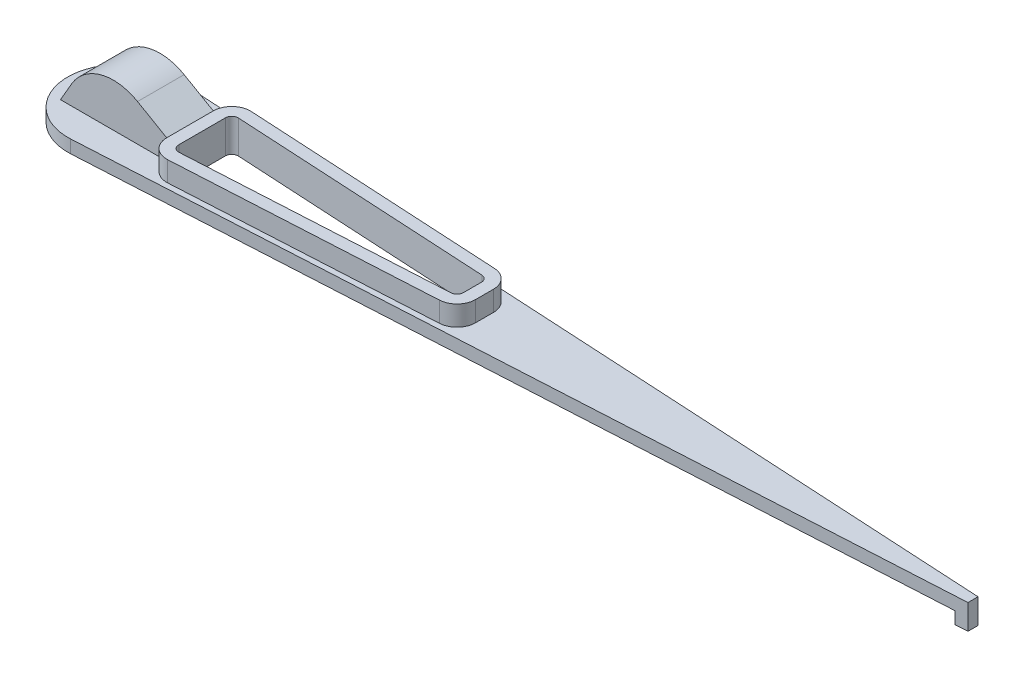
ISO-10303-21;
HEADER;
FILE_DESCRIPTION(('STEP AP214'),'2;1');
FILE_NAME('part.step','',(''),(''),'','','');
FILE_SCHEMA(('AUTOMOTIVE_DESIGN { 1 0 10303 214 1 1 1 1 }'));
ENDSEC;
DATA;
#1=APPLICATION_CONTEXT('core data for automotive mechanical design processes');
#2=APPLICATION_PROTOCOL_DEFINITION('international standard','automotive_design',2000,#1);
#3=PRODUCT_CONTEXT('',#1,'mechanical');
#4=PRODUCT('Part','Part','',(#3));
#5=PRODUCT_RELATED_PRODUCT_CATEGORY('part','',(#4));
#6=PRODUCT_DEFINITION_FORMATION('','',#4);
#7=PRODUCT_DEFINITION_CONTEXT('part definition',#1,'design');
#8=PRODUCT_DEFINITION('design','',#6,#7);
#9=PRODUCT_DEFINITION_SHAPE('','',#8);
#10=(LENGTH_UNIT() NAMED_UNIT(*) SI_UNIT(.MILLI.,.METRE.));
#11=(NAMED_UNIT(*) PLANE_ANGLE_UNIT() SI_UNIT($,.RADIAN.));
#12=(NAMED_UNIT(*) SI_UNIT($,.STERADIAN.) SOLID_ANGLE_UNIT());
#13=UNCERTAINTY_MEASURE_WITH_UNIT(LENGTH_MEASURE(1.E-05),#10,'distance_accuracy_value','');
#14=(GEOMETRIC_REPRESENTATION_CONTEXT(3) GLOBAL_UNCERTAINTY_ASSIGNED_CONTEXT((#13)) GLOBAL_UNIT_ASSIGNED_CONTEXT((#10,
#11,#12)) REPRESENTATION_CONTEXT('',''));
#15=CARTESIAN_POINT('',(0.,0.,0.));
#16=DIRECTION('',(0.,0.,1.));
#17=DIRECTION('',(1.,0.,0.));
#18=AXIS2_PLACEMENT_3D('',#15,#16,#17);
#19=CARTESIAN_POINT('',(0.,0.,0.));
#20=DIRECTION('',(0.,1.,0.));
#21=DIRECTION('',(0.,0.,1.));
#22=AXIS2_PLACEMENT_3D('',#19,#20,#21);
#23=PLANE('',#22);
#24=CARTESIAN_POINT('',(0.,0.,0.));
#25=DIRECTION('',(0.,1.,0.));
#26=DIRECTION('',(0.,0.,1.));
#27=AXIS2_PLACEMENT_3D('',#24,#25,#26);
#28=CIRCLE('',#27,5.);
#29=CARTESIAN_POINT('',(0.,0.,5.));
#30=VERTEX_POINT('',#29);
#31=EDGE_CURVE('E11',#30,#30,#28,.F.);
#32=ORIENTED_EDGE('',*,*,#31,.F.);
#33=EDGE_LOOP('',(#32));
#34=FACE_BOUND('',#33,.T.);
#35=DIRECTION('',(-0.998462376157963,0.,-0.0554335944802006));
#36=VECTOR('',#35,1.);
#37=CARTESIAN_POINT('',(43.0443468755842,0.,-1.91684451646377));
#38=LINE('',#37,#36);
#39=CARTESIAN_POINT('',(43.0443468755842,0.,-1.91684451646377));
#40=VERTEX_POINT('',#39);
#41=CARTESIAN_POINT('',(11.0443468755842,0.,-3.69345129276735));
#42=VERTEX_POINT('',#41);
#43=EDGE_CURVE('E277',#40,#42,#38,.T.);
#44=ORIENTED_EDGE('',*,*,#43,.T.);
#45=CARTESIAN_POINT('',(11.,0.,-2.89468139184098));
#46=DIRECTION('',(0.,1.,0.));
#47=DIRECTION('',(0.,0.,1.));
#48=AXIS2_PLACEMENT_3D('',#45,#46,#47);
#49=CIRCLE('',#48,0.800000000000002);
#50=CARTESIAN_POINT('',(10.2,0.,-2.89468139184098));
#51=VERTEX_POINT('',#50);
#52=EDGE_CURVE('E255',#42,#51,#49,.T.);
#53=ORIENTED_EDGE('',*,*,#52,.T.);
#54=DIRECTION('',(0.,0.,1.));
#55=VECTOR('',#54,1.);
#56=CARTESIAN_POINT('',(10.2,0.,-2.89468139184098));
#57=LINE('',#56,#55);
#58=CARTESIAN_POINT('',(10.2,0.,2.89468139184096));
#59=VERTEX_POINT('',#58);
#60=EDGE_CURVE('E258',#51,#59,#57,.T.);
#61=ORIENTED_EDGE('',*,*,#60,.T.);
#62=CARTESIAN_POINT('',(11.,0.,2.89468139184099));
#63=DIRECTION('',(0.,1.,0.));
#64=DIRECTION('',(0.,0.,1.));
#65=AXIS2_PLACEMENT_3D('',#62,#63,#64);
#66=CIRCLE('',#65,0.799999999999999);
#67=CARTESIAN_POINT('',(11.0443468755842,0.,3.69345129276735));
#68=VERTEX_POINT('',#67);
#69=EDGE_CURVE('E262',#59,#68,#66,.T.);
#70=ORIENTED_EDGE('',*,*,#69,.T.);
#71=DIRECTION('',(0.998462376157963,0.,-0.0554335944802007));
#72=VECTOR('',#71,1.);
#73=CARTESIAN_POINT('',(11.0443468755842,0.,3.69345129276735));
#74=LINE('',#73,#72);
#75=CARTESIAN_POINT('',(43.0443468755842,0.,1.91684451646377));
#76=VERTEX_POINT('',#75);
#77=EDGE_CURVE('E265',#68,#76,#74,.T.);
#78=ORIENTED_EDGE('',*,*,#77,.T.);
#79=CARTESIAN_POINT('',(43.,0.,1.11807461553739));
#80=DIRECTION('',(0.,1.,0.));
#81=DIRECTION('',(0.,0.,1.));
#82=AXIS2_PLACEMENT_3D('',#79,#80,#81);
#83=CIRCLE('',#82,0.800000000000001);
#84=CARTESIAN_POINT('',(43.8,0.,1.11807461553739));
#85=VERTEX_POINT('',#84);
#86=EDGE_CURVE('E268',#76,#85,#83,.T.);
#87=ORIENTED_EDGE('',*,*,#86,.T.);
#88=DIRECTION('',(0.,0.,-1.));
#89=VECTOR('',#88,1.);
#90=CARTESIAN_POINT('',(43.8,0.,1.11807461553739));
#91=LINE('',#90,#89);
#92=CARTESIAN_POINT('',(43.8,0.,-1.11807461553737));
#93=VERTEX_POINT('',#92);
#94=EDGE_CURVE('E271',#85,#93,#91,.T.);
#95=ORIENTED_EDGE('',*,*,#94,.T.);
#96=CARTESIAN_POINT('',(43.,0.,-1.11807461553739));
#97=DIRECTION('',(0.,1.,0.));
#98=DIRECTION('',(0.,0.,1.));
#99=AXIS2_PLACEMENT_3D('',#96,#97,#98);
#100=CIRCLE('',#99,0.800000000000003);
#101=EDGE_CURVE('E274',#93,#40,#100,.T.);
#102=ORIENTED_EDGE('',*,*,#101,.T.);
#103=EDGE_LOOP('',(#44,#53,#61,#70,#78,#87,#95,#102));
#104=FACE_BOUND('',#103,.T.);
#105=DIRECTION('',(0.,0.,-1.));
#106=VECTOR('',#105,1.);
#107=CARTESIAN_POINT('',(104.5,0.,-0.708278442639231));
#108=LINE('',#107,#106);
#109=CARTESIAN_POINT('',(104.5,0.,0.70827844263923));
#110=VERTEX_POINT('',#109);
#111=CARTESIAN_POINT('',(104.5,0.,-0.708278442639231));
#112=VERTEX_POINT('',#111);
#113=EDGE_CURVE('E225',#110,#112,#108,.T.);
#114=ORIENTED_EDGE('',*,*,#113,.F.);
#115=DIRECTION('',(0.998462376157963,0.,-0.0554335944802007));
#116=VECTOR('',#115,1.);
#117=CARTESIAN_POINT('',(106.,0.,0.625));
#118=LINE('',#117,#116);
#119=CARTESIAN_POINT('',(0.360318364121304,0.,6.49000544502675));
#120=VERTEX_POINT('',#119);
#121=EDGE_CURVE('E231',#120,#110,#118,.T.);
#122=ORIENTED_EDGE('',*,*,#121,.F.);
#123=CARTESIAN_POINT('',(0.,0.,0.));
#124=DIRECTION('',(0.,1.,0.));
#125=DIRECTION('',(0.,0.,1.));
#126=AXIS2_PLACEMENT_3D('',#123,#124,#125);
#127=CIRCLE('',#126,6.5);
#128=CARTESIAN_POINT('',(0.360318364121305,0.,-6.49000544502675));
#129=VERTEX_POINT('',#128);
#130=EDGE_CURVE('E386',#129,#120,#127,.T.);
#131=ORIENTED_EDGE('',*,*,#130,.F.);
#132=DIRECTION('',(-0.998462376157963,0.,-0.0554335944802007));
#133=VECTOR('',#132,1.);
#134=CARTESIAN_POINT('',(106.,0.,-0.625));
#135=LINE('',#134,#133);
#136=EDGE_CURVE('E374',#112,#129,#135,.T.);
#137=ORIENTED_EDGE('',*,*,#136,.F.);
#138=EDGE_LOOP('',(#114,#122,#131,#137));
#139=FACE_BOUND('',#138,.T.);
#140=ADVANCED_FACE('F36',(#34,#104,#139),#23,.F.);
#141=CARTESIAN_POINT('',(0.,1.6,0.));
#142=DIRECTION('',(0.,1.,0.));
#143=DIRECTION('',(0.,0.,1.));
#144=AXIS2_PLACEMENT_3D('',#141,#142,#143);
#145=PLANE('',#144);
#146=DIRECTION('',(-0.998462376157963,0.,-0.0554335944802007));
#147=VECTOR('',#146,1.);
#148=CARTESIAN_POINT('',(106.,1.6,-0.625));
#149=LINE('',#148,#147);
#150=CARTESIAN_POINT('',(106.,1.6,-0.625));
#151=VERTEX_POINT('',#150);
#152=CARTESIAN_POINT('',(0.360318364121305,1.6,-6.49000544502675));
#153=VERTEX_POINT('',#152);
#154=EDGE_CURVE('E375',#151,#153,#149,.T.);
#155=ORIENTED_EDGE('',*,*,#154,.T.);
#156=CARTESIAN_POINT('',(0.,1.6,0.));
#157=DIRECTION('',(0.,1.,0.));
#158=DIRECTION('',(0.,0.,1.));
#159=AXIS2_PLACEMENT_3D('',#156,#157,#158);
#160=CIRCLE('',#159,6.5);
#161=CARTESIAN_POINT('',(0.360318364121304,1.6,6.49000544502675));
#162=VERTEX_POINT('',#161);
#163=EDGE_CURVE('E378',#153,#162,#160,.T.);
#164=ORIENTED_EDGE('',*,*,#163,.T.);
#165=DIRECTION('',(0.998462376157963,0.,-0.0554335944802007));
#166=VECTOR('',#165,1.);
#167=CARTESIAN_POINT('',(106.,1.6,0.625));
#168=LINE('',#167,#166);
#169=CARTESIAN_POINT('',(106.,1.6,0.625));
#170=VERTEX_POINT('',#169);
#171=EDGE_CURVE('E380',#162,#170,#168,.T.);
#172=ORIENTED_EDGE('',*,*,#171,.T.);
#173=DIRECTION('',(0.,0.,-1.));
#174=VECTOR('',#173,1.);
#175=CARTESIAN_POINT('',(106.,1.6,-0.625));
#176=LINE('',#175,#174);
#177=EDGE_CURVE('E382',#170,#151,#176,.T.);
#178=ORIENTED_EDGE('',*,*,#177,.T.);
#179=EDGE_LOOP('',(#155,#164,#172,#178));
#180=FACE_BOUND('',#179,.T.);
#181=DIRECTION('',(0.,0.,1.));
#182=VECTOR('',#181,1.);
#183=CARTESIAN_POINT('',(-4.5,1.6,-2.89468139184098));
#184=LINE('',#183,#182);
#185=CARTESIAN_POINT('',(-4.5,1.6,-2.89468139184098));
#186=VERTEX_POINT('',#185);
#187=CARTESIAN_POINT('',(-4.5,1.6,2.89468139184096));
#188=VERTEX_POINT('',#187);
#189=EDGE_CURVE('E252',#186,#188,#184,.T.);
#190=ORIENTED_EDGE('',*,*,#189,.F.);
#191=DIRECTION('',(-1.,0.,0.));
#192=VECTOR('',#191,1.);
#193=CARTESIAN_POINT('',(8.7,1.6,-2.89468139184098));
#194=LINE('',#193,#192);
#195=CARTESIAN_POINT('',(8.7,1.6,-2.89468139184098));
#196=VERTEX_POINT('',#195);
#197=EDGE_CURVE('E246',#196,#186,#194,.T.);
#198=ORIENTED_EDGE('',*,*,#197,.F.);
#199=CARTESIAN_POINT('',(11.,1.6,-2.89468139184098));
#200=DIRECTION('',(0.,1.,0.));
#201=DIRECTION('',(0.,0.,-1.));
#202=AXIS2_PLACEMENT_3D('',#199,#200,#201);
#203=CIRCLE('',#202,2.3);
#204=CARTESIAN_POINT('',(11.1274972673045,1.6,-5.1911448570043));
#205=VERTEX_POINT('',#204);
#206=EDGE_CURVE('E304',#205,#196,#203,.T.);
#207=ORIENTED_EDGE('',*,*,#206,.F.);
#208=DIRECTION('',(-0.998462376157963,0.,-0.0554335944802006));
#209=VECTOR('',#208,1.);
#210=CARTESIAN_POINT('',(43.1274972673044,1.6,-3.41453808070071));
#211=LINE('',#210,#209);
#212=CARTESIAN_POINT('',(43.1274972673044,1.6,-3.41453808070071));
#213=VERTEX_POINT('',#212);
#214=EDGE_CURVE('E323',#213,#205,#211,.T.);
#215=ORIENTED_EDGE('',*,*,#214,.F.);
#216=CARTESIAN_POINT('',(43.,1.6,-1.11807461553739));
#217=DIRECTION('',(0.,1.,0.));
#218=DIRECTION('',(0.,0.,-1.));
#219=AXIS2_PLACEMENT_3D('',#216,#217,#218);
#220=CIRCLE('',#219,2.3);
#221=CARTESIAN_POINT('',(45.3,1.6,-1.11807461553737));
#222=VERTEX_POINT('',#221);
#223=EDGE_CURVE('E349',#222,#213,#220,.T.);
#224=ORIENTED_EDGE('',*,*,#223,.F.);
#225=DIRECTION('',(0.,0.,-1.));
#226=VECTOR('',#225,1.);
#227=CARTESIAN_POINT('',(45.3,1.6,-1.11807461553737));
#228=LINE('',#227,#226);
#229=CARTESIAN_POINT('',(45.3,1.6,1.11807461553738));
#230=VERTEX_POINT('',#229);
#231=EDGE_CURVE('E347',#230,#222,#228,.T.);
#232=ORIENTED_EDGE('',*,*,#231,.F.);
#233=CARTESIAN_POINT('',(43.,1.6,1.11807461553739));
#234=DIRECTION('',(0.,1.,0.));
#235=DIRECTION('',(0.,0.,-1.));
#236=AXIS2_PLACEMENT_3D('',#233,#234,#235);
#237=CIRCLE('',#236,2.3);
#238=CARTESIAN_POINT('',(43.1274972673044,1.6,3.41453808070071));
#239=VERTEX_POINT('',#238);
#240=EDGE_CURVE('E345',#239,#230,#237,.T.);
#241=ORIENTED_EDGE('',*,*,#240,.F.);
#242=DIRECTION('',(0.998462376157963,0.,-0.0554335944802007));
#243=VECTOR('',#242,1.);
#244=CARTESIAN_POINT('',(11.1274972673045,1.6,5.1911448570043));
#245=LINE('',#244,#243);
#246=CARTESIAN_POINT('',(11.1274972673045,1.6,5.1911448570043));
#247=VERTEX_POINT('',#246);
#248=EDGE_CURVE('E343',#247,#239,#245,.T.);
#249=ORIENTED_EDGE('',*,*,#248,.F.);
#250=CARTESIAN_POINT('',(11.,1.6,2.89468139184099));
#251=DIRECTION('',(0.,1.,0.));
#252=DIRECTION('',(0.,0.,-1.));
#253=AXIS2_PLACEMENT_3D('',#250,#251,#252);
#254=CIRCLE('',#253,2.3);
#255=CARTESIAN_POINT('',(8.7,1.6,2.89468139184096));
#256=VERTEX_POINT('',#255);
#257=EDGE_CURVE('E341',#256,#247,#254,.T.);
#258=ORIENTED_EDGE('',*,*,#257,.F.);
#259=DIRECTION('',(-1.,0.,0.));
#260=VECTOR('',#259,1.);
#261=CARTESIAN_POINT('',(8.7,1.6,2.89468139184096));
#262=LINE('',#261,#260);
#263=EDGE_CURVE('E235',#256,#188,#262,.T.);
#264=ORIENTED_EDGE('',*,*,#263,.T.);
#265=EDGE_LOOP('',(#190,#198,#207,#215,#224,#232,#241,#249,#258,#264));
#266=FACE_BOUND('',#265,.T.);
#267=ADVANCED_FACE('F422',(#180,#266),#145,.T.);
#268=CARTESIAN_POINT('',(106.,1.6,-0.625));
#269=DIRECTION('',(-0.0554335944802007,0.,0.998462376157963));
#270=DIRECTION('',(0.998462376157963,0.,0.0554335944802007));
#271=AXIS2_PLACEMENT_3D('',#268,#269,#270);
#272=PLANE('',#271);
#273=DIRECTION('',(0.,-1.,0.));
#274=VECTOR('',#273,1.);
#275=CARTESIAN_POINT('',(106.,1.6,-0.625));
#276=LINE('',#275,#274);
#277=CARTESIAN_POINT('',(106.,-1.5,-0.625));
#278=VERTEX_POINT('',#277);
#279=EDGE_CURVE('E384',#151,#278,#276,.T.);
#280=ORIENTED_EDGE('',*,*,#279,.T.);
#281=DIRECTION('',(0.998462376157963,0.,0.0554335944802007));
#282=VECTOR('',#281,1.);
#283=CARTESIAN_POINT('',(106.,-1.5,-0.625));
#284=LINE('',#283,#282);
#285=CARTESIAN_POINT('',(104.5,-1.5,-0.708278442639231));
#286=VERTEX_POINT('',#285);
#287=EDGE_CURVE('E215',#286,#278,#284,.T.);
#288=ORIENTED_EDGE('',*,*,#287,.F.);
#289=DIRECTION('',(0.,1.,0.));
#290=VECTOR('',#289,1.);
#291=CARTESIAN_POINT('',(104.5,-1.5,-0.708278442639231));
#292=LINE('',#291,#290);
#293=EDGE_CURVE('E211',#286,#112,#292,.T.);
#294=ORIENTED_EDGE('',*,*,#293,.T.);
#295=ORIENTED_EDGE('',*,*,#136,.T.);
#296=DIRECTION('',(0.,-1.,0.));
#297=VECTOR('',#296,1.);
#298=CARTESIAN_POINT('',(0.360318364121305,1.6,-6.49000544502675));
#299=LINE('',#298,#297);
#300=EDGE_CURVE('E394',#153,#129,#299,.T.);
#301=ORIENTED_EDGE('',*,*,#300,.F.);
#302=ORIENTED_EDGE('',*,*,#154,.F.);
#303=EDGE_LOOP('',(#280,#288,#294,#295,#301,#302));
#304=FACE_BOUND('',#303,.T.);
#305=ADVANCED_FACE('F428',(#304),#272,.F.);
#306=CARTESIAN_POINT('',(0.,1.6,0.));
#307=DIRECTION('',(0.,-1.,0.));
#308=DIRECTION('',(0.,0.,-1.));
#309=AXIS2_PLACEMENT_3D('',#306,#307,#308);
#310=CYLINDRICAL_SURFACE('',#309,6.5);
#311=ORIENTED_EDGE('',*,*,#130,.T.);
#312=DIRECTION('',(0.,-1.,0.));
#313=VECTOR('',#312,1.);
#314=CARTESIAN_POINT('',(0.360318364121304,1.6,6.49000544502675));
#315=LINE('',#314,#313);
#316=EDGE_CURVE('E392',#162,#120,#315,.T.);
#317=ORIENTED_EDGE('',*,*,#316,.F.);
#318=ORIENTED_EDGE('',*,*,#163,.F.);
#319=ORIENTED_EDGE('',*,*,#300,.T.);
#320=EDGE_LOOP('',(#311,#317,#318,#319));
#321=FACE_BOUND('',#320,.T.);
#322=ADVANCED_FACE('F442',(#321),#310,.T.);
#323=CARTESIAN_POINT('',(106.,1.6,0.625));
#324=DIRECTION('',(-0.0554335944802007,0.,-0.998462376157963));
#325=DIRECTION('',(-0.998462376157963,0.,0.0554335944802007));
#326=AXIS2_PLACEMENT_3D('',#323,#324,#325);
#327=PLANE('',#326);
#328=ORIENTED_EDGE('',*,*,#121,.T.);
#329=DIRECTION('',(0.,1.,0.));
#330=VECTOR('',#329,1.);
#331=CARTESIAN_POINT('',(104.5,-1.5,0.70827844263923));
#332=LINE('',#331,#330);
#333=CARTESIAN_POINT('',(104.5,-1.5,0.70827844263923));
#334=VERTEX_POINT('',#333);
#335=EDGE_CURVE('E208',#334,#110,#332,.T.);
#336=ORIENTED_EDGE('',*,*,#335,.F.);
#337=DIRECTION('',(-0.998462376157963,0.,0.0554335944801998));
#338=VECTOR('',#337,1.);
#339=CARTESIAN_POINT('',(104.5,-1.5,0.70827844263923));
#340=LINE('',#339,#338);
#341=CARTESIAN_POINT('',(106.,-1.5,0.625));
#342=VERTEX_POINT('',#341);
#343=EDGE_CURVE('E216',#342,#334,#340,.T.);
#344=ORIENTED_EDGE('',*,*,#343,.F.);
#345=DIRECTION('',(0.,-1.,0.));
#346=VECTOR('',#345,1.);
#347=CARTESIAN_POINT('',(106.,1.6,0.625));
#348=LINE('',#347,#346);
#349=EDGE_CURVE('E390',#170,#342,#348,.T.);
#350=ORIENTED_EDGE('',*,*,#349,.F.);
#351=ORIENTED_EDGE('',*,*,#171,.F.);
#352=ORIENTED_EDGE('',*,*,#316,.T.);
#353=EDGE_LOOP('',(#328,#336,#344,#350,#351,#352));
#354=FACE_BOUND('',#353,.T.);
#355=ADVANCED_FACE('F228',(#354),#327,.F.);
#356=CARTESIAN_POINT('',(106.,1.6,-0.625));
#357=DIRECTION('',(-1.,0.,0.));
#358=DIRECTION('',(0.,0.,1.));
#359=AXIS2_PLACEMENT_3D('',#356,#357,#358);
#360=PLANE('',#359);
#361=ORIENTED_EDGE('',*,*,#349,.T.);
#362=DIRECTION('',(0.,0.,1.));
#363=VECTOR('',#362,1.);
#364=CARTESIAN_POINT('',(106.,-1.5,0.625));
#365=LINE('',#364,#363);
#366=EDGE_CURVE('E222',#278,#342,#365,.T.);
#367=ORIENTED_EDGE('',*,*,#366,.F.);
#368=ORIENTED_EDGE('',*,*,#279,.F.);
#369=ORIENTED_EDGE('',*,*,#177,.F.);
#370=EDGE_LOOP('',(#361,#367,#368,#369));
#371=FACE_BOUND('',#370,.T.);
#372=ADVANCED_FACE('F435',(#371),#360,.F.);
#373=CARTESIAN_POINT('',(11.,4.1,-2.89468139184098));
#374=DIRECTION('',(0.,-1.,0.));
#375=DIRECTION('',(0.,0.,-1.));
#376=AXIS2_PLACEMENT_3D('',#373,#374,#375);
#377=CYLINDRICAL_SURFACE('',#376,2.3);
#378=ORIENTED_EDGE('',*,*,#206,.T.);
#379=DIRECTION('',(0.,-1.,0.));
#380=VECTOR('',#379,1.);
#381=CARTESIAN_POINT('',(8.7,4.1,-2.89468139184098));
#382=LINE('',#381,#380);
#383=CARTESIAN_POINT('',(8.7,4.1,-2.89468139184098));
#384=VERTEX_POINT('',#383);
#385=EDGE_CURVE('E372',#384,#196,#382,.T.);
#386=ORIENTED_EDGE('',*,*,#385,.F.);
#387=CARTESIAN_POINT('',(11.,4.1,-2.89468139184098));
#388=DIRECTION('',(0.,1.,0.));
#389=DIRECTION('',(0.,0.,-1.));
#390=AXIS2_PLACEMENT_3D('',#387,#388,#389);
#391=CIRCLE('',#390,2.3);
#392=CARTESIAN_POINT('',(11.1274972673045,4.1,-5.1911448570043));
#393=VERTEX_POINT('',#392);
#394=EDGE_CURVE('E319',#393,#384,#391,.T.);
#395=ORIENTED_EDGE('',*,*,#394,.F.);
#396=DIRECTION('',(0.,-1.,0.));
#397=VECTOR('',#396,1.);
#398=CARTESIAN_POINT('',(11.1274972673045,4.1,-5.1911448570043));
#399=LINE('',#398,#397);
#400=EDGE_CURVE('E338',#393,#205,#399,.T.);
#401=ORIENTED_EDGE('',*,*,#400,.T.);
#402=EDGE_LOOP('',(#378,#386,#395,#401));
#403=FACE_BOUND('',#402,.T.);
#404=ADVANCED_FACE('F438',(#403),#377,.T.);
#405=CARTESIAN_POINT('',(11.,4.1,2.89468139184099));
#406=DIRECTION('',(0.,-1.,0.));
#407=DIRECTION('',(0.,0.,-1.));
#408=AXIS2_PLACEMENT_3D('',#405,#406,#407);
#409=CYLINDRICAL_SURFACE('',#408,2.3);
#410=ORIENTED_EDGE('',*,*,#257,.T.);
#411=DIRECTION('',(0.,-1.,0.));
#412=VECTOR('',#411,1.);
#413=CARTESIAN_POINT('',(11.1274972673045,4.1,5.1911448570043));
#414=LINE('',#413,#412);
#415=CARTESIAN_POINT('',(11.1274972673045,4.1,5.1911448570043));
#416=VERTEX_POINT('',#415);
#417=EDGE_CURVE('E366',#416,#247,#414,.T.);
#418=ORIENTED_EDGE('',*,*,#417,.F.);
#419=CARTESIAN_POINT('',(11.,4.1,2.89468139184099));
#420=DIRECTION('',(0.,1.,0.));
#421=DIRECTION('',(0.,0.,-1.));
#422=AXIS2_PLACEMENT_3D('',#419,#420,#421);
#423=CIRCLE('',#422,2.3);
#424=CARTESIAN_POINT('',(8.7,4.1,2.89468139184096));
#425=VERTEX_POINT('',#424);
#426=EDGE_CURVE('E326',#425,#416,#423,.T.);
#427=ORIENTED_EDGE('',*,*,#426,.F.);
#428=DIRECTION('',(0.,-1.,0.));
#429=VECTOR('',#428,1.);
#430=CARTESIAN_POINT('',(8.7,4.1,2.89468139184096));
#431=LINE('',#430,#429);
#432=EDGE_CURVE('E369',#425,#256,#431,.T.);
#433=ORIENTED_EDGE('',*,*,#432,.T.);
#434=EDGE_LOOP('',(#410,#418,#427,#433));
#435=FACE_BOUND('',#434,.T.);
#436=ADVANCED_FACE('F469',(#435),#409,.T.);
#437=CARTESIAN_POINT('',(11.1274972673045,4.1,5.1911448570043));
#438=DIRECTION('',(-0.0554335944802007,0.,-0.998462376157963));
#439=DIRECTION('',(-0.998462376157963,0.,0.0554335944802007));
#440=AXIS2_PLACEMENT_3D('',#437,#438,#439);
#441=PLANE('',#440);
#442=ORIENTED_EDGE('',*,*,#248,.T.);
#443=DIRECTION('',(0.,-1.,0.));
#444=VECTOR('',#443,1.);
#445=CARTESIAN_POINT('',(43.1274972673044,4.1,3.41453808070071));
#446=LINE('',#445,#444);
#447=CARTESIAN_POINT('',(43.1274972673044,4.1,3.41453808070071));
#448=VERTEX_POINT('',#447);
#449=EDGE_CURVE('E363',#448,#239,#446,.T.);
#450=ORIENTED_EDGE('',*,*,#449,.F.);
#451=DIRECTION('',(0.998462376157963,0.,-0.0554335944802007));
#452=VECTOR('',#451,1.);
#453=CARTESIAN_POINT('',(11.1274972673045,4.1,5.1911448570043));
#454=LINE('',#453,#452);
#455=EDGE_CURVE('E328',#416,#448,#454,.T.);
#456=ORIENTED_EDGE('',*,*,#455,.F.);
#457=ORIENTED_EDGE('',*,*,#417,.T.);
#458=EDGE_LOOP('',(#442,#450,#456,#457));
#459=FACE_BOUND('',#458,.T.);
#460=ADVANCED_FACE('F476',(#459),#441,.F.);
#461=CARTESIAN_POINT('',(43.,4.1,1.11807461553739));
#462=DIRECTION('',(0.,-1.,0.));
#463=DIRECTION('',(0.,0.,-1.));
#464=AXIS2_PLACEMENT_3D('',#461,#462,#463);
#465=CYLINDRICAL_SURFACE('',#464,2.3);
#466=ORIENTED_EDGE('',*,*,#240,.T.);
#467=DIRECTION('',(0.,-1.,0.));
#468=VECTOR('',#467,1.);
#469=CARTESIAN_POINT('',(45.3,4.1,1.11807461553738));
#470=LINE('',#469,#468);
#471=CARTESIAN_POINT('',(45.3,4.1,1.11807461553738));
#472=VERTEX_POINT('',#471);
#473=EDGE_CURVE('E360',#472,#230,#470,.T.);
#474=ORIENTED_EDGE('',*,*,#473,.F.);
#475=CARTESIAN_POINT('',(43.,4.1,1.11807461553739));
#476=DIRECTION('',(0.,1.,0.));
#477=DIRECTION('',(0.,0.,-1.));
#478=AXIS2_PLACEMENT_3D('',#475,#476,#477);
#479=CIRCLE('',#478,2.3);
#480=EDGE_CURVE('E330',#448,#472,#479,.T.);
#481=ORIENTED_EDGE('',*,*,#480,.F.);
#482=ORIENTED_EDGE('',*,*,#449,.T.);
#483=EDGE_LOOP('',(#466,#474,#481,#482));
#484=FACE_BOUND('',#483,.T.);
#485=ADVANCED_FACE('F480',(#484),#465,.T.);
#486=CARTESIAN_POINT('',(45.3,4.1,-1.11807461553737));
#487=DIRECTION('',(-1.,0.,0.));
#488=DIRECTION('',(0.,0.,1.));
#489=AXIS2_PLACEMENT_3D('',#486,#487,#488);
#490=PLANE('',#489);
#491=ORIENTED_EDGE('',*,*,#231,.T.);
#492=DIRECTION('',(0.,-1.,0.));
#493=VECTOR('',#492,1.);
#494=CARTESIAN_POINT('',(45.3,4.1,-1.11807461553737));
#495=LINE('',#494,#493);
#496=CARTESIAN_POINT('',(45.3,4.1,-1.11807461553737));
#497=VERTEX_POINT('',#496);
#498=EDGE_CURVE('E357',#497,#222,#495,.T.);
#499=ORIENTED_EDGE('',*,*,#498,.F.);
#500=DIRECTION('',(0.,0.,-1.));
#501=VECTOR('',#500,1.);
#502=CARTESIAN_POINT('',(45.3,4.1,-1.11807461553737));
#503=LINE('',#502,#501);
#504=EDGE_CURVE('E332',#472,#497,#503,.T.);
#505=ORIENTED_EDGE('',*,*,#504,.F.);
#506=ORIENTED_EDGE('',*,*,#473,.T.);
#507=EDGE_LOOP('',(#491,#499,#505,#506));
#508=FACE_BOUND('',#507,.T.);
#509=ADVANCED_FACE('F500',(#508),#490,.F.);
#510=CARTESIAN_POINT('',(43.,4.1,-1.11807461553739));
#511=DIRECTION('',(0.,-1.,0.));
#512=DIRECTION('',(0.,0.,-1.));
#513=AXIS2_PLACEMENT_3D('',#510,#511,#512);
#514=CYLINDRICAL_SURFACE('',#513,2.3);
#515=ORIENTED_EDGE('',*,*,#223,.T.);
#516=DIRECTION('',(0.,-1.,0.));
#517=VECTOR('',#516,1.);
#518=CARTESIAN_POINT('',(43.1274972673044,4.1,-3.41453808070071));
#519=LINE('',#518,#517);
#520=CARTESIAN_POINT('',(43.1274972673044,4.1,-3.41453808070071));
#521=VERTEX_POINT('',#520);
#522=EDGE_CURVE('E355',#521,#213,#519,.T.);
#523=ORIENTED_EDGE('',*,*,#522,.F.);
#524=CARTESIAN_POINT('',(43.,4.1,-1.11807461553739));
#525=DIRECTION('',(0.,1.,0.));
#526=DIRECTION('',(0.,0.,-1.));
#527=AXIS2_PLACEMENT_3D('',#524,#525,#526);
#528=CIRCLE('',#527,2.3);
#529=EDGE_CURVE('E334',#497,#521,#528,.T.);
#530=ORIENTED_EDGE('',*,*,#529,.F.);
#531=ORIENTED_EDGE('',*,*,#498,.T.);
#532=EDGE_LOOP('',(#515,#523,#530,#531));
#533=FACE_BOUND('',#532,.T.);
#534=ADVANCED_FACE('F498',(#533),#514,.T.);
#535=CARTESIAN_POINT('',(43.1274972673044,4.1,-3.41453808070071));
#536=DIRECTION('',(-0.0554335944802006,0.,0.998462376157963));
#537=DIRECTION('',(0.998462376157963,0.,0.0554335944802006));
#538=AXIS2_PLACEMENT_3D('',#535,#536,#537);
#539=PLANE('',#538);
#540=ORIENTED_EDGE('',*,*,#214,.T.);
#541=ORIENTED_EDGE('',*,*,#400,.F.);
#542=DIRECTION('',(-0.998462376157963,0.,-0.0554335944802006));
#543=VECTOR('',#542,1.);
#544=CARTESIAN_POINT('',(43.1274972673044,4.1,-3.41453808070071));
#545=LINE('',#544,#543);
#546=EDGE_CURVE('E336',#521,#393,#545,.T.);
#547=ORIENTED_EDGE('',*,*,#546,.F.);
#548=ORIENTED_EDGE('',*,*,#522,.T.);
#549=EDGE_LOOP('',(#540,#541,#547,#548));
#550=FACE_BOUND('',#549,.T.);
#551=ADVANCED_FACE('F494',(#550),#539,.F.);
#552=CARTESIAN_POINT('',(11.,4.1,-2.89468139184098));
#553=DIRECTION('',(0.,-1.,0.));
#554=DIRECTION('',(0.,0.,-1.));
#555=AXIS2_PLACEMENT_3D('',#552,#553,#554);
#556=PLANE('',#555);
#557=DIRECTION('',(0.,0.,1.));
#558=VECTOR('',#557,1.);
#559=CARTESIAN_POINT('',(10.2,4.1,-2.89468139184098));
#560=LINE('',#559,#558);
#561=CARTESIAN_POINT('',(10.2,4.1,-2.89468139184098));
#562=VERTEX_POINT('',#561);
#563=CARTESIAN_POINT('',(10.2,4.1,2.89468139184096));
#564=VERTEX_POINT('',#563);
#565=EDGE_CURVE('E282',#562,#564,#560,.T.);
#566=ORIENTED_EDGE('',*,*,#565,.F.);
#567=CARTESIAN_POINT('',(11.,4.1,-2.89468139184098));
#568=DIRECTION('',(0.,1.,0.));
#569=DIRECTION('',(0.,0.,1.));
#570=AXIS2_PLACEMENT_3D('',#567,#568,#569);
#571=CIRCLE('',#570,0.800000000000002);
#572=CARTESIAN_POINT('',(11.0443468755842,4.1,-3.69345129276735));
#573=VERTEX_POINT('',#572);
#574=EDGE_CURVE('E254',#573,#562,#571,.T.);
#575=ORIENTED_EDGE('',*,*,#574,.F.);
#576=DIRECTION('',(-0.998462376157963,0.,-0.0554335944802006));
#577=VECTOR('',#576,1.);
#578=CARTESIAN_POINT('',(43.0443468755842,4.1,-1.91684451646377));
#579=LINE('',#578,#577);
#580=CARTESIAN_POINT('',(43.0443468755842,4.1,-1.91684451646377));
#581=VERTEX_POINT('',#580);
#582=EDGE_CURVE('E259',#581,#573,#579,.T.);
#583=ORIENTED_EDGE('',*,*,#582,.F.);
#584=CARTESIAN_POINT('',(43.,4.1,-1.11807461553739));
#585=DIRECTION('',(0.,1.,0.));
#586=DIRECTION('',(0.,0.,1.));
#587=AXIS2_PLACEMENT_3D('',#584,#585,#586);
#588=CIRCLE('',#587,0.800000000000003);
#589=CARTESIAN_POINT('',(43.8,4.1,-1.11807461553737));
#590=VERTEX_POINT('',#589);
#591=EDGE_CURVE('E297',#590,#581,#588,.T.);
#592=ORIENTED_EDGE('',*,*,#591,.F.);
#593=DIRECTION('',(0.,0.,-1.));
#594=VECTOR('',#593,1.);
#595=CARTESIAN_POINT('',(43.8,4.1,1.11807461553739));
#596=LINE('',#595,#594);
#597=CARTESIAN_POINT('',(43.8,4.1,1.11807461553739));
#598=VERTEX_POINT('',#597);
#599=EDGE_CURVE('E294',#598,#590,#596,.T.);
#600=ORIENTED_EDGE('',*,*,#599,.F.);
#601=CARTESIAN_POINT('',(43.,4.1,1.11807461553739));
#602=DIRECTION('',(0.,1.,0.));
#603=DIRECTION('',(0.,0.,1.));
#604=AXIS2_PLACEMENT_3D('',#601,#602,#603);
#605=CIRCLE('',#604,0.800000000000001);
#606=CARTESIAN_POINT('',(43.0443468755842,4.1,1.91684451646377));
#607=VERTEX_POINT('',#606);
#608=EDGE_CURVE('E291',#607,#598,#605,.T.);
#609=ORIENTED_EDGE('',*,*,#608,.F.);
#610=DIRECTION('',(0.998462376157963,0.,-0.0554335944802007));
#611=VECTOR('',#610,1.);
#612=CARTESIAN_POINT('',(11.0443468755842,4.1,3.69345129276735));
#613=LINE('',#612,#611);
#614=CARTESIAN_POINT('',(11.0443468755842,4.1,3.69345129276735));
#615=VERTEX_POINT('',#614);
#616=EDGE_CURVE('E288',#615,#607,#613,.T.);
#617=ORIENTED_EDGE('',*,*,#616,.F.);
#618=CARTESIAN_POINT('',(11.,4.1,2.89468139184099));
#619=DIRECTION('',(0.,1.,0.));
#620=DIRECTION('',(0.,0.,1.));
#621=AXIS2_PLACEMENT_3D('',#618,#619,#620);
#622=CIRCLE('',#621,0.799999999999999);
#623=EDGE_CURVE('E285',#564,#615,#622,.T.);
#624=ORIENTED_EDGE('',*,*,#623,.F.);
#625=EDGE_LOOP('',(#566,#575,#583,#592,#600,#609,#617,#624));
#626=FACE_BOUND('',#625,.T.);
#627=ORIENTED_EDGE('',*,*,#394,.T.);
#628=DIRECTION('',(0.,0.,1.));
#629=VECTOR('',#628,1.);
#630=CARTESIAN_POINT('',(8.7,4.1,-2.89468139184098));
#631=LINE('',#630,#629);
#632=EDGE_CURVE('E322',#384,#425,#631,.T.);
#633=ORIENTED_EDGE('',*,*,#632,.T.);
#634=ORIENTED_EDGE('',*,*,#426,.T.);
#635=ORIENTED_EDGE('',*,*,#455,.T.);
#636=ORIENTED_EDGE('',*,*,#480,.T.);
#637=ORIENTED_EDGE('',*,*,#504,.T.);
#638=ORIENTED_EDGE('',*,*,#529,.T.);
#639=ORIENTED_EDGE('',*,*,#546,.T.);
#640=EDGE_LOOP('',(#627,#633,#634,#635,#636,#637,#638,#639));
#641=FACE_BOUND('',#640,.T.);
#642=ADVANCED_FACE('F484',(#626,#641),#556,.F.);
#643=CARTESIAN_POINT('',(11.,0.,-2.89468139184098));
#644=DIRECTION('',(0.,1.,0.));
#645=DIRECTION('',(0.,0.,1.));
#646=AXIS2_PLACEMENT_3D('',#643,#644,#645);
#647=CYLINDRICAL_SURFACE('',#646,0.800000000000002);
#648=ORIENTED_EDGE('',*,*,#574,.T.);
#649=DIRECTION('',(0.,1.,0.));
#650=VECTOR('',#649,1.);
#651=CARTESIAN_POINT('',(10.2,0.,-2.89468139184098));
#652=LINE('',#651,#650);
#653=EDGE_CURVE('E280',#51,#562,#652,.T.);
#654=ORIENTED_EDGE('',*,*,#653,.F.);
#655=ORIENTED_EDGE('',*,*,#52,.F.);
#656=DIRECTION('',(0.,1.,0.));
#657=VECTOR('',#656,1.);
#658=CARTESIAN_POINT('',(11.0443468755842,0.,-3.69345129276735));
#659=LINE('',#658,#657);
#660=EDGE_CURVE('E302',#42,#573,#659,.T.);
#661=ORIENTED_EDGE('',*,*,#660,.T.);
#662=EDGE_LOOP('',(#648,#654,#655,#661));
#663=FACE_BOUND('',#662,.T.);
#664=ADVANCED_FACE('F558',(#663),#647,.F.);
#665=CARTESIAN_POINT('',(43.0443468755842,0.,-1.91684451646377));
#666=DIRECTION('',(0.0554335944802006,0.,-0.998462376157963));
#667=DIRECTION('',(-0.998462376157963,0.,-0.0554335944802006));
#668=AXIS2_PLACEMENT_3D('',#665,#666,#667);
#669=PLANE('',#668);
#670=ORIENTED_EDGE('',*,*,#582,.T.);
#671=ORIENTED_EDGE('',*,*,#660,.F.);
#672=ORIENTED_EDGE('',*,*,#43,.F.);
#673=DIRECTION('',(0.,1.,0.));
#674=VECTOR('',#673,1.);
#675=CARTESIAN_POINT('',(43.0443468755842,0.,-1.91684451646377));
#676=LINE('',#675,#674);
#677=EDGE_CURVE('E305',#40,#581,#676,.T.);
#678=ORIENTED_EDGE('',*,*,#677,.T.);
#679=EDGE_LOOP('',(#670,#671,#672,#678));
#680=FACE_BOUND('',#679,.T.);
#681=ADVANCED_FACE('F563',(#680),#669,.F.);
#682=CARTESIAN_POINT('',(43.,0.,-1.11807461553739));
#683=DIRECTION('',(0.,1.,0.));
#684=DIRECTION('',(0.,0.,1.));
#685=AXIS2_PLACEMENT_3D('',#682,#683,#684);
#686=CYLINDRICAL_SURFACE('',#685,0.800000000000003);
#687=ORIENTED_EDGE('',*,*,#591,.T.);
#688=ORIENTED_EDGE('',*,*,#677,.F.);
#689=ORIENTED_EDGE('',*,*,#101,.F.);
#690=DIRECTION('',(0.,1.,0.));
#691=VECTOR('',#690,1.);
#692=CARTESIAN_POINT('',(43.8,0.,-1.11807461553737));
#693=LINE('',#692,#691);
#694=EDGE_CURVE('E307',#93,#590,#693,.T.);
#695=ORIENTED_EDGE('',*,*,#694,.T.);
#696=EDGE_LOOP('',(#687,#688,#689,#695));
#697=FACE_BOUND('',#696,.T.);
#698=ADVANCED_FACE('F573',(#697),#686,.F.);
#699=CARTESIAN_POINT('',(43.8,0.,1.11807461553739));
#700=DIRECTION('',(1.,0.,0.));
#701=DIRECTION('',(0.,0.,-1.));
#702=AXIS2_PLACEMENT_3D('',#699,#700,#701);
#703=PLANE('',#702);
#704=ORIENTED_EDGE('',*,*,#599,.T.);
#705=ORIENTED_EDGE('',*,*,#694,.F.);
#706=ORIENTED_EDGE('',*,*,#94,.F.);
#707=DIRECTION('',(0.,1.,0.));
#708=VECTOR('',#707,1.);
#709=CARTESIAN_POINT('',(43.8,0.,1.11807461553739));
#710=LINE('',#709,#708);
#711=EDGE_CURVE('E309',#85,#598,#710,.T.);
#712=ORIENTED_EDGE('',*,*,#711,.T.);
#713=EDGE_LOOP('',(#704,#705,#706,#712));
#714=FACE_BOUND('',#713,.T.);
#715=ADVANCED_FACE('F583',(#714),#703,.F.);
#716=CARTESIAN_POINT('',(43.,0.,1.11807461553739));
#717=DIRECTION('',(0.,1.,0.));
#718=DIRECTION('',(0.,0.,1.));
#719=AXIS2_PLACEMENT_3D('',#716,#717,#718);
#720=CYLINDRICAL_SURFACE('',#719,0.800000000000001);
#721=ORIENTED_EDGE('',*,*,#608,.T.);
#722=ORIENTED_EDGE('',*,*,#711,.F.);
#723=ORIENTED_EDGE('',*,*,#86,.F.);
#724=DIRECTION('',(0.,1.,0.));
#725=VECTOR('',#724,1.);
#726=CARTESIAN_POINT('',(43.0443468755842,0.,1.91684451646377));
#727=LINE('',#726,#725);
#728=EDGE_CURVE('E311',#76,#607,#727,.T.);
#729=ORIENTED_EDGE('',*,*,#728,.T.);
#730=EDGE_LOOP('',(#721,#722,#723,#729));
#731=FACE_BOUND('',#730,.T.);
#732=ADVANCED_FACE('F593',(#731),#720,.F.);
#733=CARTESIAN_POINT('',(11.0443468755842,0.,3.69345129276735));
#734=DIRECTION('',(0.0554335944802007,0.,0.998462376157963));
#735=DIRECTION('',(0.998462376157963,0.,-0.0554335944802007));
#736=AXIS2_PLACEMENT_3D('',#733,#734,#735);
#737=PLANE('',#736);
#738=ORIENTED_EDGE('',*,*,#616,.T.);
#739=ORIENTED_EDGE('',*,*,#728,.F.);
#740=ORIENTED_EDGE('',*,*,#77,.F.);
#741=DIRECTION('',(0.,1.,0.));
#742=VECTOR('',#741,1.);
#743=CARTESIAN_POINT('',(11.0443468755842,0.,3.69345129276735));
#744=LINE('',#743,#742);
#745=EDGE_CURVE('E313',#68,#615,#744,.T.);
#746=ORIENTED_EDGE('',*,*,#745,.T.);
#747=EDGE_LOOP('',(#738,#739,#740,#746));
#748=FACE_BOUND('',#747,.T.);
#749=ADVANCED_FACE('F603',(#748),#737,.F.);
#750=CARTESIAN_POINT('',(11.,0.,2.89468139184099));
#751=DIRECTION('',(0.,1.,0.));
#752=DIRECTION('',(0.,0.,1.));
#753=AXIS2_PLACEMENT_3D('',#750,#751,#752);
#754=CYLINDRICAL_SURFACE('',#753,0.799999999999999);
#755=ORIENTED_EDGE('',*,*,#623,.T.);
#756=ORIENTED_EDGE('',*,*,#745,.F.);
#757=ORIENTED_EDGE('',*,*,#69,.F.);
#758=DIRECTION('',(0.,1.,0.));
#759=VECTOR('',#758,1.);
#760=CARTESIAN_POINT('',(10.2,0.,2.89468139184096));
#761=LINE('',#760,#759);
#762=EDGE_CURVE('E315',#59,#564,#761,.T.);
#763=ORIENTED_EDGE('',*,*,#762,.T.);
#764=EDGE_LOOP('',(#755,#756,#757,#763));
#765=FACE_BOUND('',#764,.T.);
#766=ADVANCED_FACE('F613',(#765),#754,.F.);
#767=CARTESIAN_POINT('',(10.2,0.,-2.89468139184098));
#768=DIRECTION('',(-1.,0.,0.));
#769=DIRECTION('',(0.,0.,1.));
#770=AXIS2_PLACEMENT_3D('',#767,#768,#769);
#771=PLANE('',#770);
#772=ORIENTED_EDGE('',*,*,#565,.T.);
#773=ORIENTED_EDGE('',*,*,#762,.F.);
#774=ORIENTED_EDGE('',*,*,#60,.F.);
#775=ORIENTED_EDGE('',*,*,#653,.T.);
#776=EDGE_LOOP('',(#772,#773,#774,#775));
#777=FACE_BOUND('',#776,.T.);
#778=ADVANCED_FACE('F623',(#777),#771,.F.);
#779=CARTESIAN_POINT('',(-0.117468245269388,9.19076766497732,-2.89468139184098));
#780=DIRECTION('',(0.866025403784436,-0.500000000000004,0.));
#781=DIRECTION('',(0.500000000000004,0.866025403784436,0.));
#782=AXIS2_PLACEMENT_3D('',#779,#780,#781);
#783=PLANE('',#782);
#784=DIRECTION('',(0.500000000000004,0.866025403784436,0.));
#785=VECTOR('',#784,1.);
#786=CARTESIAN_POINT('',(-0.117468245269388,9.19076766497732,2.89468139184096));
#787=LINE('',#786,#785);
#788=CARTESIAN_POINT('',(-3.11746824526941,3.9946152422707,2.89468139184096));
#789=VERTEX_POINT('',#788);
#790=EDGE_CURVE('E242',#188,#789,#787,.T.);
#791=ORIENTED_EDGE('',*,*,#790,.T.);
#792=DIRECTION('',(0.,0.,1.));
#793=VECTOR('',#792,1.);
#794=CARTESIAN_POINT('',(-3.11746824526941,3.99461524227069,-2.89468139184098));
#795=LINE('',#794,#793);
#796=CARTESIAN_POINT('',(-3.11746824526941,3.9946152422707,-2.89468139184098));
#797=VERTEX_POINT('',#796);
#798=EDGE_CURVE('E51',#789,#797,#795,.F.);
#799=ORIENTED_EDGE('',*,*,#798,.T.);
#800=DIRECTION('',(0.500000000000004,0.866025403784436,0.));
#801=VECTOR('',#800,1.);
#802=CARTESIAN_POINT('',(-0.117468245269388,9.19076766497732,-2.89468139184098));
#803=LINE('',#802,#801);
#804=EDGE_CURVE('E248',#186,#797,#803,.T.);
#805=ORIENTED_EDGE('',*,*,#804,.F.);
#806=ORIENTED_EDGE('',*,*,#189,.T.);
#807=EDGE_LOOP('',(#791,#799,#805,#806));
#808=FACE_BOUND('',#807,.T.);
#809=ADVANCED_FACE('F465',(#808),#783,.F.);
#810=CARTESIAN_POINT('',(8.7,4.1,-2.89468139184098));
#811=DIRECTION('',(-0.500000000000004,-0.866025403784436,0.));
#812=DIRECTION('',(0.866025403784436,-0.500000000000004,0.));
#813=AXIS2_PLACEMENT_3D('',#810,#811,#812);
#814=PLANE('',#813);
#815=DIRECTION('',(0.866025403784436,-0.500000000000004,0.));
#816=VECTOR('',#815,1.);
#817=CARTESIAN_POINT('',(8.7,4.1,-2.89468139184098));
#818=LINE('',#817,#816);
#819=CARTESIAN_POINT('',(5.07868417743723,6.19076766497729,-2.89468139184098));
#820=VERTEX_POINT('',#819);
#821=EDGE_CURVE('E250',#820,#384,#818,.T.);
#822=ORIENTED_EDGE('',*,*,#821,.F.);
#823=DIRECTION('',(0.,0.,1.));
#824=VECTOR('',#823,1.);
#825=CARTESIAN_POINT('',(5.07868417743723,6.19076766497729,-2.89468139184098));
#826=LINE('',#825,#824);
#827=CARTESIAN_POINT('',(5.07868417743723,6.19076766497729,2.89468139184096));
#828=VERTEX_POINT('',#827);
#829=EDGE_CURVE('E397',#820,#828,#826,.T.);
#830=ORIENTED_EDGE('',*,*,#829,.T.);
#831=DIRECTION('',(0.866025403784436,-0.500000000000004,0.));
#832=VECTOR('',#831,1.);
#833=CARTESIAN_POINT('',(8.7,4.1,2.89468139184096));
#834=LINE('',#833,#832);
#835=EDGE_CURVE('E244',#828,#425,#834,.T.);
#836=ORIENTED_EDGE('',*,*,#835,.T.);
#837=ORIENTED_EDGE('',*,*,#632,.F.);
#838=EDGE_LOOP('',(#822,#830,#836,#837));
#839=FACE_BOUND('',#838,.T.);
#840=ADVANCED_FACE('F409',(#839),#814,.F.);
#841=CARTESIAN_POINT('',(8.7,1.6,-2.89468139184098));
#842=DIRECTION('',(0.,0.,1.));
#843=DIRECTION('',(1.,0.,0.));
#844=AXIS2_PLACEMENT_3D('',#841,#842,#843);
#845=PLANE('',#844);
#846=ORIENTED_EDGE('',*,*,#804,.T.);
#847=CARTESIAN_POINT('',(2.0786841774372,0.994615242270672,-2.89468139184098));
#848=DIRECTION('',(0.,0.,1.));
#849=DIRECTION('',(1.,0.,0.));
#850=AXIS2_PLACEMENT_3D('',#847,#848,#849);
#851=CIRCLE('',#850,6.);
#852=EDGE_CURVE('E44',#797,#820,#851,.F.);
#853=ORIENTED_EDGE('',*,*,#852,.T.);
#854=ORIENTED_EDGE('',*,*,#821,.T.);
#855=ORIENTED_EDGE('',*,*,#385,.T.);
#856=ORIENTED_EDGE('',*,*,#197,.T.);
#857=EDGE_LOOP('',(#846,#853,#854,#855,#856));
#858=FACE_BOUND('',#857,.T.);
#859=ADVANCED_FACE('F404',(#858),#845,.F.);
#860=CARTESIAN_POINT('',(8.7,1.6,2.89468139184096));
#861=DIRECTION('',(0.,0.,1.));
#862=DIRECTION('',(1.,0.,0.));
#863=AXIS2_PLACEMENT_3D('',#860,#861,#862);
#864=PLANE('',#863);
#865=ORIENTED_EDGE('',*,*,#835,.F.);
#866=CARTESIAN_POINT('',(2.0786841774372,0.994615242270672,2.89468139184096));
#867=DIRECTION('',(0.,0.,1.));
#868=DIRECTION('',(1.,0.,0.));
#869=AXIS2_PLACEMENT_3D('',#866,#867,#868);
#870=CIRCLE('',#869,6.);
#871=EDGE_CURVE('E59',#828,#789,#870,.T.);
#872=ORIENTED_EDGE('',*,*,#871,.T.);
#873=ORIENTED_EDGE('',*,*,#790,.F.);
#874=ORIENTED_EDGE('',*,*,#263,.F.);
#875=ORIENTED_EDGE('',*,*,#432,.F.);
#876=EDGE_LOOP('',(#865,#872,#873,#874,#875));
#877=FACE_BOUND('',#876,.T.);
#878=ADVANCED_FACE('F412',(#877),#864,.T.);
#879=CARTESIAN_POINT('',(2.0786841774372,0.994615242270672,-2.89468139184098));
#880=DIRECTION('',(0.,0.,1.));
#881=DIRECTION('',(1.,0.,0.));
#882=AXIS2_PLACEMENT_3D('',#879,#880,#881);
#883=CYLINDRICAL_SURFACE('',#882,6.);
#884=ORIENTED_EDGE('',*,*,#852,.F.);
#885=ORIENTED_EDGE('',*,*,#798,.F.);
#886=ORIENTED_EDGE('',*,*,#871,.F.);
#887=ORIENTED_EDGE('',*,*,#829,.F.);
#888=EDGE_LOOP('',(#884,#885,#886,#887));
#889=FACE_BOUND('',#888,.T.);
#890=ADVANCED_FACE('F38',(#889),#883,.T.);
#891=CARTESIAN_POINT('',(0.,-1.,0.));
#892=DIRECTION('',(0.,1.,0.));
#893=DIRECTION('',(0.,0.,1.));
#894=AXIS2_PLACEMENT_3D('',#891,#892,#893);
#895=CYLINDRICAL_SURFACE('',#894,5.);
#896=CARTESIAN_POINT('',(0.,-1.,0.));
#897=DIRECTION('',(0.,-1.,0.));
#898=DIRECTION('',(0.,0.,-1.));
#899=AXIS2_PLACEMENT_3D('',#896,#897,#898);
#900=CIRCLE('',#899,5.);
#901=CARTESIAN_POINT('',(0.,-1.,-5.));
#902=VERTEX_POINT('',#901);
#903=EDGE_CURVE('E232',#902,#902,#900,.T.);
#904=ORIENTED_EDGE('',*,*,#903,.F.);
#905=EDGE_LOOP('',(#904));
#906=FACE_BOUND('',#905,.T.);
#907=ORIENTED_EDGE('',*,*,#31,.T.);
#908=EDGE_LOOP('',(#907));
#909=FACE_BOUND('',#908,.T.);
#910=ADVANCED_FACE('F411',(#906,#909),#895,.T.);
#911=CARTESIAN_POINT('',(0.,-1.,0.));
#912=DIRECTION('',(0.,-1.,0.));
#913=DIRECTION('',(0.,0.,-1.));
#914=AXIS2_PLACEMENT_3D('',#911,#912,#913);
#915=PLANE('',#914);
#916=ORIENTED_EDGE('',*,*,#903,.T.);
#917=EDGE_LOOP('',(#916));
#918=FACE_BOUND('',#917,.T.);
#919=ADVANCED_FACE('F417',(#918),#915,.T.);
#920=CARTESIAN_POINT('',(104.5,-1.5,-0.708278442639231));
#921=DIRECTION('',(1.,0.,0.));
#922=DIRECTION('',(0.,0.,-1.));
#923=AXIS2_PLACEMENT_3D('',#920,#921,#922);
#924=PLANE('',#923);
#925=ORIENTED_EDGE('',*,*,#113,.T.);
#926=ORIENTED_EDGE('',*,*,#293,.F.);
#927=DIRECTION('',(0.,0.,-1.));
#928=VECTOR('',#927,1.);
#929=CARTESIAN_POINT('',(104.5,-1.5,-0.708278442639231));
#930=LINE('',#929,#928);
#931=EDGE_CURVE('E204',#334,#286,#930,.T.);
#932=ORIENTED_EDGE('',*,*,#931,.F.);
#933=ORIENTED_EDGE('',*,*,#335,.T.);
#934=EDGE_LOOP('',(#925,#926,#932,#933));
#935=FACE_BOUND('',#934,.T.);
#936=ADVANCED_FACE('F206',(#935),#924,.F.);
#937=CARTESIAN_POINT('',(106.,-1.5,0.625));
#938=DIRECTION('',(0.,1.,0.));
#939=DIRECTION('',(0.,0.,1.));
#940=AXIS2_PLACEMENT_3D('',#937,#938,#939);
#941=PLANE('',#940);
#942=ORIENTED_EDGE('',*,*,#343,.T.);
#943=ORIENTED_EDGE('',*,*,#931,.T.);
#944=ORIENTED_EDGE('',*,*,#287,.T.);
#945=ORIENTED_EDGE('',*,*,#366,.T.);
#946=EDGE_LOOP('',(#942,#943,#944,#945));
#947=FACE_BOUND('',#946,.T.);
#948=ADVANCED_FACE('F220',(#947),#941,.F.);
#949=CLOSED_SHELL('',(#140,#267,#305,#322,#355,#372,#404,#436,#460,#485,#509,#534,#551,#642,
#664,#681,#698,#715,#732,#749,#766,#778,#809,#840,#859,#878,#890,#910,#919,#936,#948));
#950=MANIFOLD_SOLID_BREP('B2',#949);
#951=ADVANCED_BREP_SHAPE_REPRESENTATION('',(#18,#950),#14);
#952=SHAPE_DEFINITION_REPRESENTATION(#9,#951);
ENDSEC;
END-ISO-10303-21;
